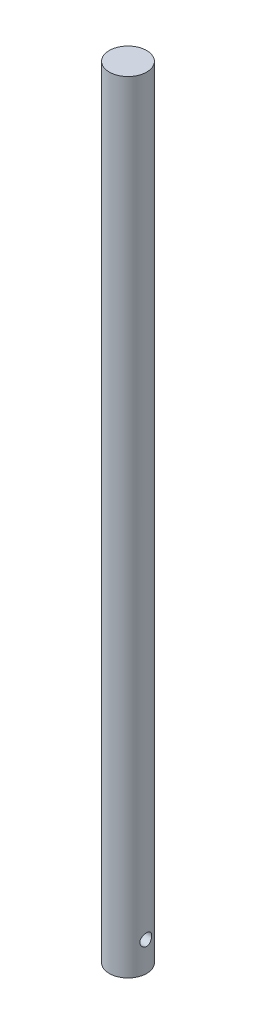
ISO-10303-21;
HEADER;
FILE_DESCRIPTION(('STEP AP214'),'2;1');
FILE_NAME('part.step','',(''),(''),'','','');
FILE_SCHEMA(('AUTOMOTIVE_DESIGN { 1 0 10303 214 1 1 1 1 }'));
ENDSEC;
DATA;
#1=APPLICATION_CONTEXT('core data for automotive mechanical design processes');
#2=APPLICATION_PROTOCOL_DEFINITION('international standard','automotive_design',2000,#1);
#3=PRODUCT_CONTEXT('',#1,'mechanical');
#4=PRODUCT('Part','Part','',(#3));
#5=PRODUCT_RELATED_PRODUCT_CATEGORY('part','',(#4));
#6=PRODUCT_DEFINITION_FORMATION('','',#4);
#7=PRODUCT_DEFINITION_CONTEXT('part definition',#1,'design');
#8=PRODUCT_DEFINITION('design','',#6,#7);
#9=PRODUCT_DEFINITION_SHAPE('','',#8);
#10=(LENGTH_UNIT() NAMED_UNIT(*) SI_UNIT(.MILLI.,.METRE.));
#11=(NAMED_UNIT(*) PLANE_ANGLE_UNIT() SI_UNIT($,.RADIAN.));
#12=(NAMED_UNIT(*) SI_UNIT($,.STERADIAN.) SOLID_ANGLE_UNIT());
#13=UNCERTAINTY_MEASURE_WITH_UNIT(LENGTH_MEASURE(1.E-05),#10,'distance_accuracy_value','');
#14=(GEOMETRIC_REPRESENTATION_CONTEXT(3) GLOBAL_UNCERTAINTY_ASSIGNED_CONTEXT((#13)) GLOBAL_UNIT_ASSIGNED_CONTEXT((#10,
#11,#12)) REPRESENTATION_CONTEXT('',''));
#15=CARTESIAN_POINT('',(0.,0.,0.));
#16=DIRECTION('',(0.,0.,1.));
#17=DIRECTION('',(1.,0.,0.));
#18=AXIS2_PLACEMENT_3D('',#15,#16,#17);
#19=CARTESIAN_POINT('',(0.,530.,0.));
#20=DIRECTION('',(0.,-1.,0.));
#21=DIRECTION('',(0.,0.,-1.));
#22=AXIS2_PLACEMENT_3D('',#19,#20,#21);
#23=CYLINDRICAL_SURFACE('',#22,12.7);
#24=CARTESIAN_POINT('',(-12.0536301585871,20.,-4.00000000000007));
#25=CARTESIAN_POINT('',(-12.0536312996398,19.7813854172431,-3.99999878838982));
#26=CARTESIAN_POINT('',(-12.0596426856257,19.5627582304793,-3.98201705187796));
#27=CARTESIAN_POINT('',(-12.0829303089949,19.1319330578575,-3.91077517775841));
#28=CARTESIAN_POINT('',(-12.1002094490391,18.919736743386,-3.85750594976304));
#29=CARTESIAN_POINT('',(-12.1438855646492,18.5080768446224,-3.71770739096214));
#30=CARTESIAN_POINT('',(-12.1702662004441,18.3085911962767,-3.63123763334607));
#31=CARTESIAN_POINT('',(-12.2291500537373,17.926901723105,-3.42769192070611));
#32=CARTESIAN_POINT('',(-12.2616543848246,17.7447010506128,-3.3106103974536));
#33=CARTESIAN_POINT('',(-12.3303954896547,17.3963949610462,-3.04478875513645));
#34=CARTESIAN_POINT('',(-12.3667178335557,17.230981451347,-2.89516394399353));
#35=CARTESIAN_POINT('',(-12.4382748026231,16.9271301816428,-2.57039552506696));
#36=CARTESIAN_POINT('',(-12.4735092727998,16.7886962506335,-2.39524830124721));
#37=CARTESIAN_POINT('',(-12.5399007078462,16.539670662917,-2.01942465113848));
#38=CARTESIAN_POINT('',(-12.5709451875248,16.4297929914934,-1.81825351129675));
#39=CARTESIAN_POINT('',(-12.6244584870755,16.2457025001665,-1.39914197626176));
#40=CARTESIAN_POINT('',(-12.6469293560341,16.171481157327,-1.18120560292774));
#41=CARTESIAN_POINT('',(-12.680157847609,16.0631245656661,-0.741995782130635));
#42=CARTESIAN_POINT('',(-12.691260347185,16.0278064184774,-0.521040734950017));
#43=CARTESIAN_POINT('',(-12.7017199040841,15.9945093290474,-0.0760806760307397));
#44=CARTESIAN_POINT('',(-12.7010796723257,15.9965217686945,0.147923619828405));
#45=CARTESIAN_POINT('',(-12.6883653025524,16.0370537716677,0.584292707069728));
#46=CARTESIAN_POINT('',(-12.6766928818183,16.0742907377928,0.796790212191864));
#47=CARTESIAN_POINT('',(-12.6437209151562,16.1821083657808,1.21235019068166));
#48=CARTESIAN_POINT('',(-12.6224207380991,16.2526912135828,1.41541204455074));
#49=CARTESIAN_POINT('',(-12.5720505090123,16.4260123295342,1.80927793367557));
#50=CARTESIAN_POINT('',(-12.542887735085,16.5291370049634,1.99989958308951));
#51=CARTESIAN_POINT('',(-12.4798607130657,16.7643035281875,2.36152909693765));
#52=CARTESIAN_POINT('',(-12.4459952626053,16.8963527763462,2.53253192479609));
#53=CARTESIAN_POINT('',(-12.3754728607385,17.1921912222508,2.8577157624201));
#54=CARTESIAN_POINT('',(-12.3387584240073,17.3570867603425,3.01087921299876));
#55=CARTESIAN_POINT('',(-12.2679089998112,17.7105627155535,3.28768556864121));
#56=CARTESIAN_POINT('',(-12.2337743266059,17.8991460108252,3.41132488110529));
#57=CARTESIAN_POINT('',(-12.1716563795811,18.2975591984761,3.62678246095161));
#58=CARTESIAN_POINT('',(-12.1437484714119,18.5076087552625,3.71821788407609));
#59=CARTESIAN_POINT('',(-12.0981264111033,18.9412154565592,3.86409720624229));
#60=CARTESIAN_POINT('',(-12.0804085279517,19.1647676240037,3.91855464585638));
#61=CARTESIAN_POINT('',(-12.0580026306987,19.6092720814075,3.98695661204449));
#62=CARTESIAN_POINT('',(-12.0528130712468,19.8299590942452,4.00246160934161));
#63=CARTESIAN_POINT('',(-12.0546578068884,20.2707987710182,3.9969038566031));
#64=CARTESIAN_POINT('',(-12.0616901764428,20.4909515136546,3.97584686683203));
#65=CARTESIAN_POINT('',(-12.0866906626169,20.9177120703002,3.89915836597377));
#66=CARTESIAN_POINT('',(-12.1043298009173,21.1245278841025,3.84456592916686));
#67=CARTESIAN_POINT('',(-12.1482062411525,21.5260389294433,3.70357924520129));
#68=CARTESIAN_POINT('',(-12.1744449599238,21.7207321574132,3.6171797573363));
#69=CARTESIAN_POINT('',(-12.2335097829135,22.0987293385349,3.41216957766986));
#70=CARTESIAN_POINT('',(-12.2665050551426,22.2815383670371,3.29269634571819));
#71=CARTESIAN_POINT('',(-12.3350175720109,22.6250812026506,3.02593360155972));
#72=CARTESIAN_POINT('',(-12.3705354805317,22.7858091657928,2.87863674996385));
#73=CARTESIAN_POINT('',(-12.441904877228,23.0876256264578,2.55301552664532));
#74=CARTESIAN_POINT('',(-12.4777071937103,23.2275991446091,2.37364412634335));
#75=CARTESIAN_POINT('',(-12.5441158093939,23.475506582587,1.99309076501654));
#76=CARTESIAN_POINT('',(-12.5747223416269,23.5834419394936,1.79190978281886));
#77=CARTESIAN_POINT('',(-12.6271190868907,23.7631771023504,1.3746643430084));
#78=CARTESIAN_POINT('',(-12.6489723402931,23.8352362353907,1.15871992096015));
#79=CARTESIAN_POINT('',(-12.681677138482,23.9417685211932,0.71696583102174));
#80=CARTESIAN_POINT('',(-12.6925321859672,23.9762536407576,0.491159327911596));
#81=CARTESIAN_POINT('',(-12.7017816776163,24.0056745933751,0.0463466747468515));
#82=CARTESIAN_POINT('',(-12.7006831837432,24.0022197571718,-0.172543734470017));
#83=CARTESIAN_POINT('',(-12.6873674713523,23.9597596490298,-0.606483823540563));
#84=CARTESIAN_POINT('',(-12.6751509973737,23.9207567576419,-0.821533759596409));
#85=CARTESIAN_POINT('',(-12.641135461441,23.8093377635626,-1.23896278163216));
#86=CARTESIAN_POINT('',(-12.6194618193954,23.7373583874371,-1.44146937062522));
#87=CARTESIAN_POINT('',(-12.5687663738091,23.5624251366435,-1.83162710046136));
#88=CARTESIAN_POINT('',(-12.5397433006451,23.4594659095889,-2.01927566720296));
#89=CARTESIAN_POINT('',(-12.4761347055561,23.2214146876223,-2.38139336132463));
#90=CARTESIAN_POINT('',(-12.4413925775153,23.0853419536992,-2.55518996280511));
#91=CARTESIAN_POINT('',(-12.3707068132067,22.7866488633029,-2.87801570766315));
#92=CARTESIAN_POINT('',(-12.3347628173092,22.6240205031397,-3.027037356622));
#93=CARTESIAN_POINT('',(-12.2642979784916,22.2702436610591,-3.30117192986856));
#94=CARTESIAN_POINT('',(-12.2298663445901,22.0783167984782,-3.42530611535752));
#95=CARTESIAN_POINT('',(-12.1678698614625,21.6752857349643,-3.63942799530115));
#96=CARTESIAN_POINT('',(-12.1403023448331,21.4641890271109,-3.72942896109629));
#97=CARTESIAN_POINT('',(-12.0973189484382,21.046307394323,-3.86647437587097));
#98=CARTESIAN_POINT('',(-12.0811024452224,20.8405474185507,-3.91639751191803));
#99=CARTESIAN_POINT('',(-12.0592588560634,20.4231945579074,-3.98315666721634));
#100=CARTESIAN_POINT('',(-12.0536290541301,20.2116031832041,-4.0000011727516));
#101=CARTESIAN_POINT('',(-12.0536301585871,20.,-4.00000000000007));
#102=B_SPLINE_CURVE_WITH_KNOTS('',3,(#24,#25,#26,#27,#28,#29,#30,#31,#32,#33,#34,#35,#36,#37,
#38,#39,#40,#41,#42,#43,#44,#45,#46,#47,#48,#49,#50,#51,#52,#53,#54,#55,#56,#57,#58,#59,#60,#61,
#62,#63,#64,#65,#66,#67,#68,#69,#70,#71,#72,#73,#74,#75,#76,#77,#78,#79,#80,#81,#82,#83,#84,#85,
#86,#87,#88,#89,#90,#91,#92,#93,#94,#95,#96,#97,#98,#99,#100,#101),.UNSPECIFIED.,.T.,.F.,(4,2,2,
2,2,2,2,2,2,2,2,2,2,2,2,2,2,2,2,2,2,2,2,2,2,2,2,2,2,2,2,2,2,2,2,2,2,2,4),(0.,0.655061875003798,
1.31029256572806,1.96435300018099,2.61853248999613,3.29341624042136,3.9683957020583,
4.65890721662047,5.34925359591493,6.01797425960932,6.68654054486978,7.33166354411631,
7.97682883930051,8.629963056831,9.28326457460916,9.96420121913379,10.6452206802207,
11.3340826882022,12.0226923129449,12.6832411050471,13.3436858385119,13.9846326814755,
14.6256851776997,15.2853535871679,15.9451962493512,16.6328835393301,17.3205399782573,
18.0031508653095,18.6855442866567,19.339107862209,19.9926276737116,20.6377321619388,
21.2829481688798,21.9502877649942,22.6178288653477,23.3079402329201,23.9977830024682,
24.6319984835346,25.2660512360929),.UNSPECIFIED.);
#103=CARTESIAN_POINT('',(-12.0536301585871,20.,-4.00000000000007));
#104=VERTEX_POINT('',#103);
#105=EDGE_CURVE('E34',#104,#104,#102,.T.);
#106=ORIENTED_EDGE('',*,*,#105,.F.);
#107=EDGE_LOOP('',(#106));
#108=FACE_BOUND('',#107,.T.);
#109=CARTESIAN_POINT('',(12.0536301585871,20.,3.99999999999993));
#110=CARTESIAN_POINT('',(12.0536312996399,20.218614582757,3.99999878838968));
#111=CARTESIAN_POINT('',(12.0596426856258,20.4372417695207,3.98201705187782));
#112=CARTESIAN_POINT('',(12.082930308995,20.8680669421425,3.91077517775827));
#113=CARTESIAN_POINT('',(12.1002094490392,21.080263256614,3.8575059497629));
#114=CARTESIAN_POINT('',(12.1438855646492,21.4919231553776,3.71770739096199));
#115=CARTESIAN_POINT('',(12.1702662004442,21.6914088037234,3.63123763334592));
#116=CARTESIAN_POINT('',(12.2291500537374,22.0730982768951,3.42769192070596));
#117=CARTESIAN_POINT('',(12.2616543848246,22.2552989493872,3.31061039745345));
#118=CARTESIAN_POINT('',(12.3303954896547,22.6036050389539,3.0447887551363));
#119=CARTESIAN_POINT('',(12.3667178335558,22.769018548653,2.89516394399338));
#120=CARTESIAN_POINT('',(12.4382748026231,23.0728698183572,2.5703955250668));
#121=CARTESIAN_POINT('',(12.4735092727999,23.2113037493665,2.39524830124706));
#122=CARTESIAN_POINT('',(12.5399007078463,23.4603293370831,2.01942465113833));
#123=CARTESIAN_POINT('',(12.5709451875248,23.5702070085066,1.81825351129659));
#124=CARTESIAN_POINT('',(12.6244584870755,23.7542974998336,1.3991419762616));
#125=CARTESIAN_POINT('',(12.6469293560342,23.828518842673,1.18120560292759));
#126=CARTESIAN_POINT('',(12.680157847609,23.9368754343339,0.741995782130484));
#127=CARTESIAN_POINT('',(12.6912603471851,23.9721935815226,0.521040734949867));
#128=CARTESIAN_POINT('',(12.7017199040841,24.0054906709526,0.076080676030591));
#129=CARTESIAN_POINT('',(12.7010796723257,24.0034782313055,-0.147923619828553));
#130=CARTESIAN_POINT('',(12.6883653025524,23.9629462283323,-0.584292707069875));
#131=CARTESIAN_POINT('',(12.6766928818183,23.9257092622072,-0.796790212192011));
#132=CARTESIAN_POINT('',(12.6437209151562,23.8178916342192,-1.2123501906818));
#133=CARTESIAN_POINT('',(12.6224207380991,23.7473087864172,-1.41541204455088));
#134=CARTESIAN_POINT('',(12.5720505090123,23.5739876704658,-1.80927793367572));
#135=CARTESIAN_POINT('',(12.542887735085,23.4708629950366,-1.99989958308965));
#136=CARTESIAN_POINT('',(12.4798607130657,23.2356964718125,-2.3615290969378));
#137=CARTESIAN_POINT('',(12.4459952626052,23.1036472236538,-2.53253192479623));
#138=CARTESIAN_POINT('',(12.3754728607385,22.8078087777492,-2.85771576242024));
#139=CARTESIAN_POINT('',(12.3387584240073,22.6429132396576,-3.0108792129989));
#140=CARTESIAN_POINT('',(12.2679089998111,22.2894372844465,-3.28768556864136));
#141=CARTESIAN_POINT('',(12.2337743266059,22.1008539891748,-3.41132488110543));
#142=CARTESIAN_POINT('',(12.1716563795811,21.7024408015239,-3.62678246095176));
#143=CARTESIAN_POINT('',(12.1437484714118,21.4923912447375,-3.71821788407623));
#144=CARTESIAN_POINT('',(12.0981264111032,21.0587845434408,-3.86409720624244));
#145=CARTESIAN_POINT('',(12.0804085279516,20.8352323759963,-3.91855464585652));
#146=CARTESIAN_POINT('',(12.0580026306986,20.3907279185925,-3.98695661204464));
#147=CARTESIAN_POINT('',(12.0528130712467,20.1700409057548,-4.00246160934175));
#148=CARTESIAN_POINT('',(12.0546578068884,19.7292012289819,-3.99690385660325));
#149=CARTESIAN_POINT('',(12.0616901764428,19.5090484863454,-3.97584686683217));
#150=CARTESIAN_POINT('',(12.0866906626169,19.0822879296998,-3.89915836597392));
#151=CARTESIAN_POINT('',(12.1043298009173,18.8754721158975,-3.844565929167));
#152=CARTESIAN_POINT('',(12.1482062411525,18.4739610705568,-3.70357924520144));
#153=CARTESIAN_POINT('',(12.1744449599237,18.2792678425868,-3.61717975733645));
#154=CARTESIAN_POINT('',(12.2335097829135,17.9012706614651,-3.41216957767));
#155=CARTESIAN_POINT('',(12.2665050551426,17.718461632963,-3.29269634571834));
#156=CARTESIAN_POINT('',(12.3350175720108,17.3749187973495,-3.02593360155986));
#157=CARTESIAN_POINT('',(12.3705354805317,17.2141908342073,-2.878636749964));
#158=CARTESIAN_POINT('',(12.441904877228,16.9123743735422,-2.55301552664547));
#159=CARTESIAN_POINT('',(12.4777071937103,16.7724008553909,-2.37364412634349));
#160=CARTESIAN_POINT('',(12.5441158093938,16.524493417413,-1.99309076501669));
#161=CARTESIAN_POINT('',(12.5747223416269,16.4165580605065,-1.79190978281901));
#162=CARTESIAN_POINT('',(12.6271190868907,16.2368228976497,-1.37466434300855));
#163=CARTESIAN_POINT('',(12.6489723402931,16.1647637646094,-1.15871992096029));
#164=CARTESIAN_POINT('',(12.681677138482,16.0582314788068,-0.716965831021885));
#165=CARTESIAN_POINT('',(12.6925321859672,16.0237463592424,-0.491159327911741));
#166=CARTESIAN_POINT('',(12.7017816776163,15.9943254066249,-0.0463466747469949));
#167=CARTESIAN_POINT('',(12.7006831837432,15.9977802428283,0.172543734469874));
#168=CARTESIAN_POINT('',(12.6873674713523,16.0402403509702,0.606483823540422));
#169=CARTESIAN_POINT('',(12.6751509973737,16.0792432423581,0.821533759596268));
#170=CARTESIAN_POINT('',(12.641135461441,16.1906622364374,1.23896278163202));
#171=CARTESIAN_POINT('',(12.6194618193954,16.262641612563,1.44146937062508));
#172=CARTESIAN_POINT('',(12.5687663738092,16.4375748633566,1.83162710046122));
#173=CARTESIAN_POINT('',(12.5397433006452,16.5405340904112,2.01927566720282));
#174=CARTESIAN_POINT('',(12.4761347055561,16.7785853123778,2.38139336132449));
#175=CARTESIAN_POINT('',(12.4413925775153,16.9146580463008,2.55518996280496));
#176=CARTESIAN_POINT('',(12.3707068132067,17.2133511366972,2.87801570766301));
#177=CARTESIAN_POINT('',(12.3347628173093,17.3759794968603,3.02703735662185));
#178=CARTESIAN_POINT('',(12.2642979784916,17.729756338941,3.30117192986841));
#179=CARTESIAN_POINT('',(12.2298663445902,17.9216832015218,3.42530611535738));
#180=CARTESIAN_POINT('',(12.1678698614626,18.3247142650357,3.63942799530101));
#181=CARTESIAN_POINT('',(12.1403023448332,18.5358109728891,3.72942896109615));
#182=CARTESIAN_POINT('',(12.0973189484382,18.9536926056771,3.86647437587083));
#183=CARTESIAN_POINT('',(12.0811024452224,19.1594525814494,3.91639751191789));
#184=CARTESIAN_POINT('',(12.0592588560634,19.5768054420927,3.9831566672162));
#185=CARTESIAN_POINT('',(12.0536290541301,19.7883968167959,4.00000117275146));
#186=CARTESIAN_POINT('',(12.0536301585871,20.,3.99999999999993));
#187=B_SPLINE_CURVE_WITH_KNOTS('',3,(#109,#110,#111,#112,#113,#114,#115,#116,#117,#118,#119,
#120,#121,#122,#123,#124,#125,#126,#127,#128,#129,#130,#131,#132,#133,#134,#135,#136,#137,#138,
#139,#140,#141,#142,#143,#144,#145,#146,#147,#148,#149,#150,#151,#152,#153,#154,#155,#156,#157,
#158,#159,#160,#161,#162,#163,#164,#165,#166,#167,#168,#169,#170,#171,#172,#173,#174,#175,#176,
#177,#178,#179,#180,#181,#182,#183,#184,#185,#186),.UNSPECIFIED.,.T.,.F.,(4,2,2,2,2,2,2,2,2,2,2,
2,2,2,2,2,2,2,2,2,2,2,2,2,2,2,2,2,2,2,2,2,2,2,2,2,2,2,4),(0.,0.655061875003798,1.31029256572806,
1.96435300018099,2.61853248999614,3.29341624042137,3.96839570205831,4.65890721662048,
5.34925359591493,6.01797425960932,6.68654054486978,7.33166354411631,7.97682883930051,
8.629963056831,9.28326457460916,9.96420121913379,10.6452206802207,11.3340826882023,
12.0226923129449,12.6832411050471,13.3436858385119,13.9846326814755,14.6256851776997,
15.2853535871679,15.9451962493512,16.63288353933,17.3205399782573,18.0031508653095,
18.6855442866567,19.339107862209,19.9926276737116,20.6377321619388,21.2829481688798,
21.9502877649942,22.6178288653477,23.3079402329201,23.9977830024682,24.6319984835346,
25.2660512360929),.UNSPECIFIED.);
#188=CARTESIAN_POINT('',(12.0536301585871,20.,3.99999999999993));
#189=VERTEX_POINT('',#188);
#190=EDGE_CURVE('E38',#189,#189,#187,.T.);
#191=ORIENTED_EDGE('',*,*,#190,.T.);
#192=EDGE_LOOP('',(#191));
#193=FACE_BOUND('',#192,.T.);
#194=CARTESIAN_POINT('',(0.,530.,0.));
#195=DIRECTION('',(0.,1.,0.));
#196=DIRECTION('',(0.,0.,1.));
#197=AXIS2_PLACEMENT_3D('',#194,#195,#196);
#198=CIRCLE('',#197,12.7);
#199=CARTESIAN_POINT('',(0.,530.,12.7));
#200=VERTEX_POINT('',#199);
#201=EDGE_CURVE('E10',#200,#200,#198,.T.);
#202=ORIENTED_EDGE('',*,*,#201,.F.);
#203=EDGE_LOOP('',(#202));
#204=FACE_BOUND('',#203,.T.);
#205=CARTESIAN_POINT('',(0.,0.,0.));
#206=DIRECTION('',(0.,1.,0.));
#207=DIRECTION('',(0.,0.,1.));
#208=AXIS2_PLACEMENT_3D('',#205,#206,#207);
#209=CIRCLE('',#208,12.7);
#210=CARTESIAN_POINT('',(0.,0.,12.7));
#211=VERTEX_POINT('',#210);
#212=EDGE_CURVE('E30',#211,#211,#209,.T.);
#213=ORIENTED_EDGE('',*,*,#212,.T.);
#214=EDGE_LOOP('',(#213));
#215=FACE_BOUND('',#214,.T.);
#216=ADVANCED_FACE('F24',(#108,#193,#204,#215),#23,.T.);
#217=CARTESIAN_POINT('',(0.,530.,0.));
#218=DIRECTION('',(0.,1.,0.));
#219=DIRECTION('',(0.,0.,1.));
#220=AXIS2_PLACEMENT_3D('',#217,#218,#219);
#221=PLANE('',#220);
#222=ORIENTED_EDGE('',*,*,#201,.T.);
#223=EDGE_LOOP('',(#222));
#224=FACE_BOUND('',#223,.T.);
#225=ADVANCED_FACE('F55',(#224),#221,.T.);
#226=CARTESIAN_POINT('',(0.,0.,0.));
#227=DIRECTION('',(0.,1.,0.));
#228=DIRECTION('',(0.,0.,1.));
#229=AXIS2_PLACEMENT_3D('',#226,#227,#228);
#230=PLANE('',#229);
#231=ORIENTED_EDGE('',*,*,#212,.F.);
#232=EDGE_LOOP('',(#231));
#233=FACE_BOUND('',#232,.T.);
#234=ADVANCED_FACE('F53',(#233),#230,.F.);
#235=CARTESIAN_POINT('',(-12.701,20.,0.));
#236=DIRECTION('',(1.,0.,0.));
#237=DIRECTION('',(0.,0.,-1.));
#238=AXIS2_PLACEMENT_3D('',#235,#236,#237);
#239=CYLINDRICAL_SURFACE('',#238,4.);
#240=ORIENTED_EDGE('',*,*,#105,.T.);
#241=EDGE_LOOP('',(#240));
#242=FACE_BOUND('',#241,.T.);
#243=ORIENTED_EDGE('',*,*,#190,.F.);
#244=EDGE_LOOP('',(#243));
#245=FACE_BOUND('',#244,.T.);
#246=ADVANCED_FACE('F49',(#242,#245),#239,.F.);
#247=CLOSED_SHELL('',(#216,#225,#234,#246));
#248=MANIFOLD_SOLID_BREP('B2',#247);
#249=ADVANCED_BREP_SHAPE_REPRESENTATION('',(#18,#248),#14);
#250=SHAPE_DEFINITION_REPRESENTATION(#9,#249);
ENDSEC;
END-ISO-10303-21;
